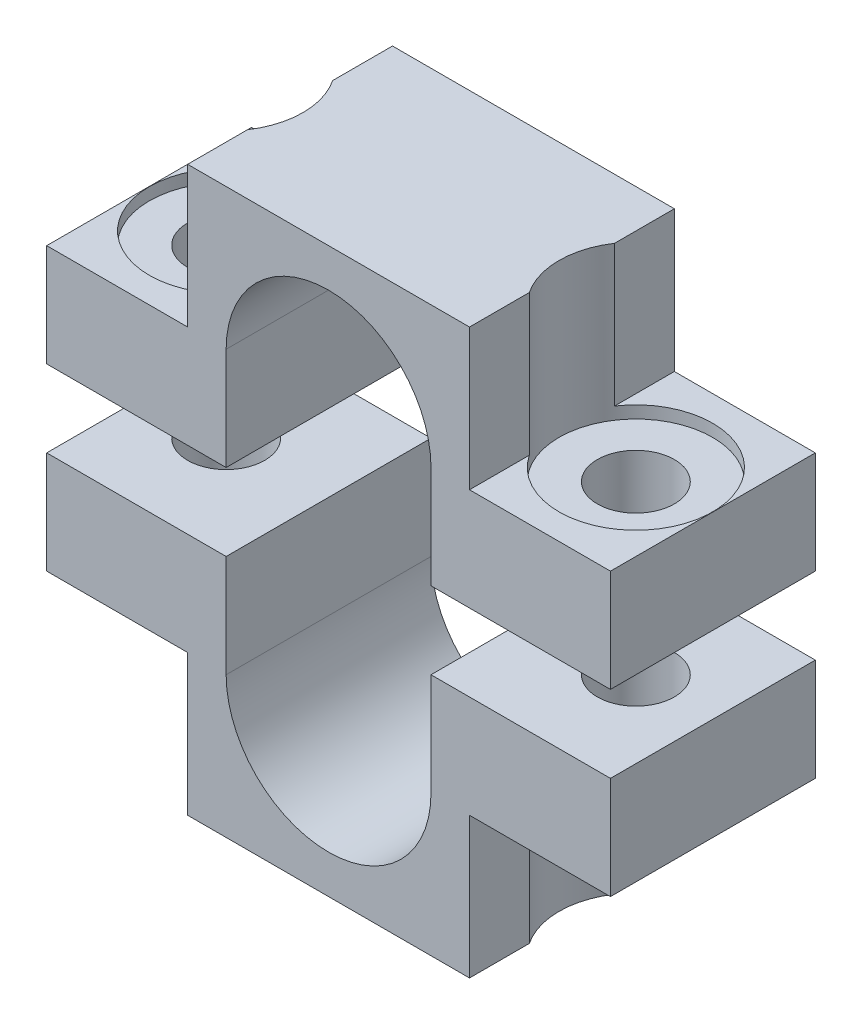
from build123d import *

# Parameters (mm, degrees)
BOSS_EXTRUDE1_DEPTH     = 6.35
CUT_EXTRUDE1_DEPTH      = 5.08
CUT_EXTRUDE1_DEPTH_BACK = 12.7
SKETCH4_R               = 2.3876
CUT_EXTRUDE2_DEPTH      = 12.7
CUT_EXTRUDE2_DEPTH_BACK = 0.762
SKETCH5_R               = 4.7625


with BuildPart() as part:
    # Sketch2 → Boss-Extrude1 (new, symmetric)
    with BuildSketch(Plane.XY):
        with BuildLine():
            Line((6.35, 0), (6.35, -6.35))
            Line((6.35, -6.35), (17.4752, -6.35))
            Line((17.4752, -6.35), (17.4752, 0))
            Line((17.4752, 0), (8.7376, 0))
            Line((8.7376, 0), (8.7376, 8.7376))
            Line((8.7376, 8.7376), (-8.7376, 8.7376))
            Line((-8.7376, 8.7376), (-8.7376, 0))
            Line((-8.7376, 0), (-17.4752, 0))
            Line((-17.4752, 0), (-17.4752, -6.35))
            Line((-17.4752, -6.35), (-6.35, -6.35))
            Line((-6.35, -6.35), (-6.35, 0))
            ThreePointArc((-6.35, 0), (0, 6.35), (6.35, 0))
        make_face()
    extrude(amount=BOSS_EXTRUDE1_DEPTH, both=True)

    # Sketch4 → Cut-Extrude1 (cut, two sides: drawn at the far end of the back side and taken through both)
    with BuildSketch(Plane(origin=(0, 0, 0), x_dir=(1, 0, 0), z_dir=(0, 1, 0)).offset(-CUT_EXTRUDE1_DEPTH_BACK)):
        with Locations((-12.7, 0)):
            Circle(SKETCH4_R)
        with Locations((12.7, 0)):
            Circle(SKETCH4_R)
    extrude(amount=CUT_EXTRUDE1_DEPTH + CUT_EXTRUDE1_DEPTH_BACK, mode=Mode.SUBTRACT)

    # Sketch5 → Cut-Extrude2 (cut, two sides: drawn at the far end of the back side and taken through both)
    with BuildSketch(Plane(origin=(0, 0, 0), x_dir=(1, 0, 0), z_dir=(0, 1, 0)).offset(-CUT_EXTRUDE2_DEPTH_BACK)):
        with Locations(Location((-12.7, 0, 0), (0, 0, 180))):
            Circle(SKETCH5_R)
        with Locations(Location((12.7, 0, 0), (0, 0, 180))):
            Circle(SKETCH5_R)
    extrude(amount=CUT_EXTRUDE2_DEPTH + CUT_EXTRUDE2_DEPTH_BACK, mode=Mode.SUBTRACT)


with BuildPart() as body_2:
    # Mirror1: mirrored copy
    add(part.part.mirror(Plane(origin=(0, -8.7376, 0), x_dir=(0, 0, 1), z_dir=(0, -1, 0))))


solid = Compound([part.part, body_2.part])
